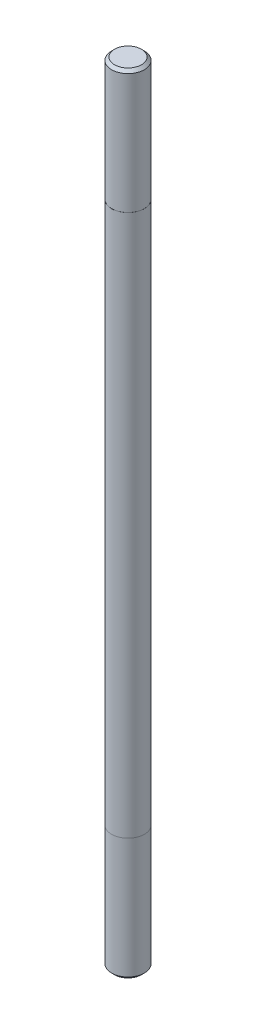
ISO-10303-21;
HEADER;
FILE_DESCRIPTION(('STEP AP214'),'2;1');
FILE_NAME('part.step','',(''),(''),'','','');
FILE_SCHEMA(('AUTOMOTIVE_DESIGN { 1 0 10303 214 1 1 1 1 }'));
ENDSEC;
DATA;
#1=APPLICATION_CONTEXT('core data for automotive mechanical design processes');
#2=APPLICATION_PROTOCOL_DEFINITION('international standard','automotive_design',2000,#1);
#3=PRODUCT_CONTEXT('',#1,'mechanical');
#4=PRODUCT('Part','Part','',(#3));
#5=PRODUCT_RELATED_PRODUCT_CATEGORY('part','',(#4));
#6=PRODUCT_DEFINITION_FORMATION('','',#4);
#7=PRODUCT_DEFINITION_CONTEXT('part definition',#1,'design');
#8=PRODUCT_DEFINITION('design','',#6,#7);
#9=PRODUCT_DEFINITION_SHAPE('','',#8);
#10=(LENGTH_UNIT() NAMED_UNIT(*) SI_UNIT(.MILLI.,.METRE.));
#11=(NAMED_UNIT(*) PLANE_ANGLE_UNIT() SI_UNIT($,.RADIAN.));
#12=(NAMED_UNIT(*) SI_UNIT($,.STERADIAN.) SOLID_ANGLE_UNIT());
#13=UNCERTAINTY_MEASURE_WITH_UNIT(LENGTH_MEASURE(1.E-05),#10,'distance_accuracy_value','');
#14=(GEOMETRIC_REPRESENTATION_CONTEXT(3) GLOBAL_UNCERTAINTY_ASSIGNED_CONTEXT((#13)) GLOBAL_UNIT_ASSIGNED_CONTEXT((#10,
#11,#12)) REPRESENTATION_CONTEXT('',''));
#15=CARTESIAN_POINT('',(0.,0.,0.));
#16=DIRECTION('',(0.,0.,1.));
#17=DIRECTION('',(1.,0.,0.));
#18=AXIS2_PLACEMENT_3D('',#15,#16,#17);
#19=CARTESIAN_POINT('',(0.,0.,0.));
#20=DIRECTION('',(0.,1.,0.));
#21=DIRECTION('',(0.,0.,1.));
#22=AXIS2_PLACEMENT_3D('',#19,#20,#21);
#23=PLANE('',#22);
#24=CARTESIAN_POINT('',(0.,0.,0.));
#25=DIRECTION('',(0.,1.,0.));
#26=DIRECTION('',(0.,0.,1.));
#27=AXIS2_PLACEMENT_3D('',#24,#25,#26);
#28=CIRCLE('',#27,2.);
#29=CARTESIAN_POINT('',(0.,0.,2.));
#30=VERTEX_POINT('',#29);
#31=EDGE_CURVE('E56',#30,#30,#28,.T.);
#32=ORIENTED_EDGE('',*,*,#31,.F.);
#33=EDGE_LOOP('',(#32));
#34=FACE_BOUND('',#33,.T.);
#35=CARTESIAN_POINT('',(0.,0.,0.));
#36=DIRECTION('',(0.,1.,0.));
#37=DIRECTION('',(0.,0.,1.));
#38=AXIS2_PLACEMENT_3D('',#35,#36,#37);
#39=CIRCLE('',#38,1.99);
#40=CARTESIAN_POINT('',(0.,0.,1.99));
#41=VERTEX_POINT('',#40);
#42=EDGE_CURVE('E50',#41,#41,#39,.F.);
#43=ORIENTED_EDGE('',*,*,#42,.F.);
#44=EDGE_LOOP('',(#43));
#45=FACE_BOUND('',#44,.T.);
#46=ADVANCED_FACE('F30',(#34,#45),#23,.F.);
#47=CARTESIAN_POINT('',(0.,66.,0.));
#48=DIRECTION('',(0.,1.,0.));
#49=DIRECTION('',(0.,0.,1.));
#50=AXIS2_PLACEMENT_3D('',#47,#48,#49);
#51=PLANE('',#50);
#52=CARTESIAN_POINT('',(0.,66.,0.));
#53=DIRECTION('',(0.,1.,0.));
#54=DIRECTION('',(0.,0.,1.));
#55=AXIS2_PLACEMENT_3D('',#52,#53,#54);
#56=CIRCLE('',#55,2.);
#57=CARTESIAN_POINT('',(0.,66.,2.));
#58=VERTEX_POINT('',#57);
#59=EDGE_CURVE('E53',#58,#58,#56,.T.);
#60=ORIENTED_EDGE('',*,*,#59,.T.);
#61=EDGE_LOOP('',(#60));
#62=FACE_BOUND('',#61,.T.);
#63=CARTESIAN_POINT('',(0.,66.,0.));
#64=DIRECTION('',(0.,1.,0.));
#65=DIRECTION('',(0.,0.,1.));
#66=AXIS2_PLACEMENT_3D('',#63,#64,#65);
#67=CIRCLE('',#66,1.99);
#68=CARTESIAN_POINT('',(0.,66.,1.99));
#69=VERTEX_POINT('',#68);
#70=EDGE_CURVE('E59',#69,#69,#67,.T.);
#71=ORIENTED_EDGE('',*,*,#70,.F.);
#72=EDGE_LOOP('',(#71));
#73=FACE_BOUND('',#72,.T.);
#74=ADVANCED_FACE('F65',(#62,#73),#51,.T.);
#75=CARTESIAN_POINT('',(0.,66.,0.));
#76=DIRECTION('',(0.,-1.,0.));
#77=DIRECTION('',(0.,0.,-1.));
#78=AXIS2_PLACEMENT_3D('',#75,#76,#77);
#79=CYLINDRICAL_SURFACE('',#78,2.);
#80=ORIENTED_EDGE('',*,*,#59,.F.);
#81=EDGE_LOOP('',(#80));
#82=FACE_BOUND('',#81,.T.);
#83=ORIENTED_EDGE('',*,*,#31,.T.);
#84=EDGE_LOOP('',(#83));
#85=FACE_BOUND('',#84,.T.);
#86=ADVANCED_FACE('F32',(#82,#85),#79,.T.);
#87=CARTESIAN_POINT('',(0.,81.,0.));
#88=DIRECTION('',(0.,-1.,0.));
#89=DIRECTION('',(0.,0.,-1.));
#90=AXIS2_PLACEMENT_3D('',#87,#88,#89);
#91=CYLINDRICAL_SURFACE('',#90,1.99);
#92=CARTESIAN_POINT('',(0.,80.65,0.));
#93=DIRECTION('',(0.,1.,0.));
#94=DIRECTION('',(0.,0.,1.));
#95=AXIS2_PLACEMENT_3D('',#92,#93,#94);
#96=CIRCLE('',#95,1.99);
#97=CARTESIAN_POINT('',(0.,80.65,1.99));
#98=VERTEX_POINT('',#97);
#99=EDGE_CURVE('E10',#98,#98,#96,.F.);
#100=ORIENTED_EDGE('',*,*,#99,.T.);
#101=EDGE_LOOP('',(#100));
#102=FACE_BOUND('',#101,.T.);
#103=ORIENTED_EDGE('',*,*,#70,.T.);
#104=EDGE_LOOP('',(#103));
#105=FACE_BOUND('',#104,.T.);
#106=ADVANCED_FACE('F63',(#102,#105),#91,.T.);
#107=CARTESIAN_POINT('',(0.,81.,0.));
#108=DIRECTION('',(0.,1.,0.));
#109=DIRECTION('',(0.,0.,1.));
#110=AXIS2_PLACEMENT_3D('',#107,#108,#109);
#111=PLANE('',#110);
#112=CARTESIAN_POINT('',(0.,81.,0.));
#113=DIRECTION('',(0.,1.,0.));
#114=DIRECTION('',(0.,0.,1.));
#115=AXIS2_PLACEMENT_3D('',#112,#113,#114);
#116=CIRCLE('',#115,1.63999999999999);
#117=CARTESIAN_POINT('',(0.,81.,1.63999999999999));
#118=VERTEX_POINT('',#117);
#119=EDGE_CURVE('E37',#118,#118,#116,.T.);
#120=ORIENTED_EDGE('',*,*,#119,.T.);
#121=EDGE_LOOP('',(#120));
#122=FACE_BOUND('',#121,.T.);
#123=ADVANCED_FACE('F78',(#122),#111,.T.);
#124=CARTESIAN_POINT('',(0.,-15.,0.));
#125=DIRECTION('',(0.,1.,0.));
#126=DIRECTION('',(0.,0.,1.));
#127=AXIS2_PLACEMENT_3D('',#124,#125,#126);
#128=CYLINDRICAL_SURFACE('',#127,1.99);
#129=CARTESIAN_POINT('',(0.,-14.65,0.));
#130=DIRECTION('',(0.,-1.,0.));
#131=DIRECTION('',(0.,0.,-1.));
#132=AXIS2_PLACEMENT_3D('',#129,#130,#131);
#133=CIRCLE('',#132,1.99);
#134=CARTESIAN_POINT('',(0.,-14.65,-1.99));
#135=VERTEX_POINT('',#134);
#136=EDGE_CURVE('E41',#135,#135,#133,.F.);
#137=ORIENTED_EDGE('',*,*,#136,.T.);
#138=EDGE_LOOP('',(#137));
#139=FACE_BOUND('',#138,.T.);
#140=ORIENTED_EDGE('',*,*,#42,.T.);
#141=EDGE_LOOP('',(#140));
#142=FACE_BOUND('',#141,.T.);
#143=ADVANCED_FACE('F81',(#139,#142),#128,.T.);
#144=CARTESIAN_POINT('',(0.,-15.,0.));
#145=DIRECTION('',(0.,-1.,0.));
#146=DIRECTION('',(0.,0.,-1.));
#147=AXIS2_PLACEMENT_3D('',#144,#145,#146);
#148=PLANE('',#147);
#149=CARTESIAN_POINT('',(0.,-15.,0.));
#150=DIRECTION('',(0.,-1.,0.));
#151=DIRECTION('',(0.,0.,-1.));
#152=AXIS2_PLACEMENT_3D('',#149,#150,#151);
#153=CIRCLE('',#152,1.64);
#154=CARTESIAN_POINT('',(0.,-15.,-1.64));
#155=VERTEX_POINT('',#154);
#156=EDGE_CURVE('E45',#155,#155,#153,.T.);
#157=ORIENTED_EDGE('',*,*,#156,.T.);
#158=EDGE_LOOP('',(#157));
#159=FACE_BOUND('',#158,.T.);
#160=ADVANCED_FACE('F84',(#159),#148,.T.);
#161=CARTESIAN_POINT('',(0.,-15.,0.));
#162=DIRECTION('',(0.,1.,0.));
#163=DIRECTION('',(0.,0.,1.));
#164=AXIS2_PLACEMENT_3D('',#161,#162,#163);
#165=CONICAL_SURFACE('',#164,1.64,0.785398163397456);
#166=ORIENTED_EDGE('',*,*,#136,.F.);
#167=EDGE_LOOP('',(#166));
#168=FACE_BOUND('',#167,.T.);
#169=ORIENTED_EDGE('',*,*,#156,.F.);
#170=EDGE_LOOP('',(#169));
#171=FACE_BOUND('',#170,.T.);
#172=ADVANCED_FACE('F88',(#168,#171),#165,.T.);
#173=CARTESIAN_POINT('',(0.,81.,0.));
#174=DIRECTION('',(0.,-1.,0.));
#175=DIRECTION('',(0.,0.,-1.));
#176=AXIS2_PLACEMENT_3D('',#173,#174,#175);
#177=CONICAL_SURFACE('',#176,1.63999999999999,0.78539816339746);
#178=ORIENTED_EDGE('',*,*,#99,.F.);
#179=EDGE_LOOP('',(#178));
#180=FACE_BOUND('',#179,.T.);
#181=ORIENTED_EDGE('',*,*,#119,.F.);
#182=EDGE_LOOP('',(#181));
#183=FACE_BOUND('',#182,.T.);
#184=ADVANCED_FACE('F92',(#180,#183),#177,.T.);
#185=CLOSED_SHELL('',(#46,#74,#86,#106,#123,#143,#160,#172,#184));
#186=MANIFOLD_SOLID_BREP('B2',#185);
#187=ADVANCED_BREP_SHAPE_REPRESENTATION('',(#18,#186),#14);
#188=SHAPE_DEFINITION_REPRESENTATION(#9,#187);
ENDSEC;
END-ISO-10303-21;
